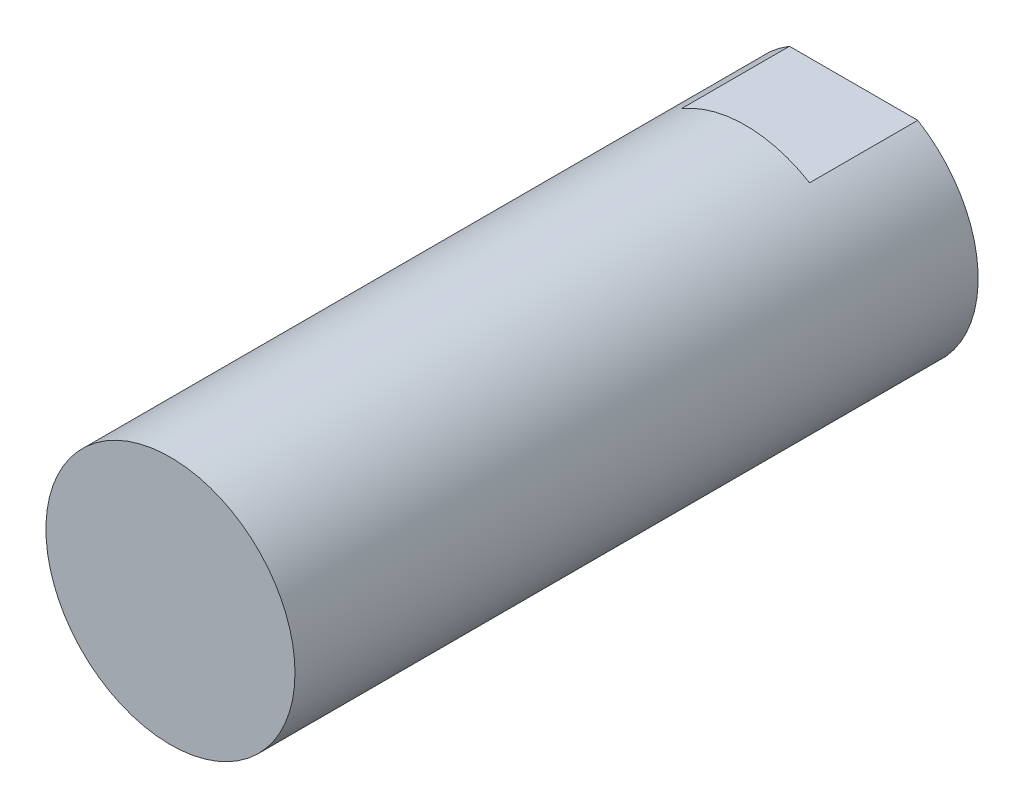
ISO-10303-21;
HEADER;
FILE_DESCRIPTION(('STEP AP214'),'2;1');
FILE_NAME('part.step','',(''),(''),'','','');
FILE_SCHEMA(('AUTOMOTIVE_DESIGN { 1 0 10303 214 1 1 1 1 }'));
ENDSEC;
DATA;
#1=APPLICATION_CONTEXT('core data for automotive mechanical design processes');
#2=APPLICATION_PROTOCOL_DEFINITION('international standard','automotive_design',2000,#1);
#3=PRODUCT_CONTEXT('',#1,'mechanical');
#4=PRODUCT('Part','Part','',(#3));
#5=PRODUCT_RELATED_PRODUCT_CATEGORY('part','',(#4));
#6=PRODUCT_DEFINITION_FORMATION('','',#4);
#7=PRODUCT_DEFINITION_CONTEXT('part definition',#1,'design');
#8=PRODUCT_DEFINITION('design','',#6,#7);
#9=PRODUCT_DEFINITION_SHAPE('','',#8);
#10=(LENGTH_UNIT() NAMED_UNIT(*) SI_UNIT(.MILLI.,.METRE.));
#11=(NAMED_UNIT(*) PLANE_ANGLE_UNIT() SI_UNIT($,.RADIAN.));
#12=(NAMED_UNIT(*) SI_UNIT($,.STERADIAN.) SOLID_ANGLE_UNIT());
#13=UNCERTAINTY_MEASURE_WITH_UNIT(LENGTH_MEASURE(1.E-05),#10,'distance_accuracy_value','');
#14=(GEOMETRIC_REPRESENTATION_CONTEXT(3) GLOBAL_UNCERTAINTY_ASSIGNED_CONTEXT((#13)) GLOBAL_UNIT_ASSIGNED_CONTEXT((#10,
#11,#12)) REPRESENTATION_CONTEXT('',''));
#15=CARTESIAN_POINT('',(0.,0.,0.));
#16=DIRECTION('',(0.,0.,1.));
#17=DIRECTION('',(1.,0.,0.));
#18=AXIS2_PLACEMENT_3D('',#15,#16,#17);
#19=CARTESIAN_POINT('',(0.,0.,22.86));
#20=DIRECTION('',(0.,0.,-1.));
#21=DIRECTION('',(-1.,0.,0.));
#22=AXIS2_PLACEMENT_3D('',#19,#20,#21);
#23=CYLINDRICAL_SURFACE('',#22,11.1125);
#24=DIRECTION('',(0.,0.,-1.));
#25=VECTOR('',#24,1.);
#26=CARTESIAN_POINT('',(5.72381264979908,9.525,22.86));
#27=LINE('',#26,#25);
#28=CARTESIAN_POINT('',(5.72381264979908,9.525,9.652));
#29=VERTEX_POINT('',#28);
#30=CARTESIAN_POINT('',(5.72381264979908,9.525,0.));
#31=VERTEX_POINT('',#30);
#32=EDGE_CURVE('E58',#29,#31,#27,.T.);
#33=ORIENTED_EDGE('',*,*,#32,.F.);
#34=CARTESIAN_POINT('',(0.,0.,9.652));
#35=DIRECTION('',(0.,0.,-1.));
#36=DIRECTION('',(-1.,0.,0.));
#37=AXIS2_PLACEMENT_3D('',#34,#35,#36);
#38=CIRCLE('',#37,11.1125);
#39=CARTESIAN_POINT('',(-5.72381264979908,9.525,9.652));
#40=VERTEX_POINT('',#39);
#41=EDGE_CURVE('E12',#40,#29,#38,.T.);
#42=ORIENTED_EDGE('',*,*,#41,.F.);
#43=DIRECTION('',(0.,0.,-1.));
#44=VECTOR('',#43,1.);
#45=CARTESIAN_POINT('',(-5.72381264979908,9.525,22.86));
#46=LINE('',#45,#44);
#47=CARTESIAN_POINT('',(-5.72381264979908,9.525,0.));
#48=VERTEX_POINT('',#47);
#49=EDGE_CURVE('E114',#48,#40,#46,.F.);
#50=ORIENTED_EDGE('',*,*,#49,.F.);
#51=CARTESIAN_POINT('',(0.,0.,0.));
#52=DIRECTION('',(0.,0.,1.));
#53=DIRECTION('',(1.,0.,0.));
#54=AXIS2_PLACEMENT_3D('',#51,#52,#53);
#55=CIRCLE('',#54,11.1125);
#56=CARTESIAN_POINT('',(-5.72381264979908,-9.525,0.));
#57=VERTEX_POINT('',#56);
#58=EDGE_CURVE('E94',#48,#57,#55,.T.);
#59=ORIENTED_EDGE('',*,*,#58,.T.);
#60=DIRECTION('',(0.,0.,-1.));
#61=VECTOR('',#60,1.);
#62=CARTESIAN_POINT('',(-5.72381264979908,-9.525,22.86));
#63=LINE('',#62,#61);
#64=CARTESIAN_POINT('',(-5.72381264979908,-9.525,9.652));
#65=VERTEX_POINT('',#64);
#66=EDGE_CURVE('E50',#65,#57,#63,.T.);
#67=ORIENTED_EDGE('',*,*,#66,.F.);
#68=CARTESIAN_POINT('',(5.72381264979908,-9.525,9.652));
#69=VERTEX_POINT('',#68);
#70=EDGE_CURVE('E39',#69,#65,#38,.T.);
#71=ORIENTED_EDGE('',*,*,#70,.F.);
#72=DIRECTION('',(0.,0.,-1.));
#73=VECTOR('',#72,1.);
#74=CARTESIAN_POINT('',(5.72381264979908,-9.525,22.86));
#75=LINE('',#74,#73);
#76=CARTESIAN_POINT('',(5.72381264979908,-9.525,0.));
#77=VERTEX_POINT('',#76);
#78=EDGE_CURVE('E77',#77,#69,#75,.F.);
#79=ORIENTED_EDGE('',*,*,#78,.F.);
#80=EDGE_CURVE('E90',#77,#31,#55,.T.);
#81=ORIENTED_EDGE('',*,*,#80,.T.);
#82=EDGE_LOOP('',(#33,#42,#50,#59,#67,#71,#79,#81));
#83=FACE_BOUND('',#82,.T.);
#84=CARTESIAN_POINT('',(0.,0.,60.96));
#85=DIRECTION('',(0.,0.,1.));
#86=DIRECTION('',(1.,0.,0.));
#87=AXIS2_PLACEMENT_3D('',#84,#85,#86);
#88=CIRCLE('',#87,11.1125);
#89=CARTESIAN_POINT('',(11.1125,0.,60.96));
#90=VERTEX_POINT('',#89);
#91=EDGE_CURVE('E163',#90,#90,#88,.T.);
#92=ORIENTED_EDGE('',*,*,#91,.F.);
#93=EDGE_LOOP('',(#92));
#94=FACE_BOUND('',#93,.T.);
#95=ADVANCED_FACE('F36',(#83,#94),#23,.T.);
#96=CARTESIAN_POINT('',(0.,0.,0.));
#97=DIRECTION('',(0.,0.,1.));
#98=DIRECTION('',(1.,0.,0.));
#99=AXIS2_PLACEMENT_3D('',#96,#97,#98);
#100=PLANE('',#99);
#101=CARTESIAN_POINT('',(0.,0.,0.));
#102=DIRECTION('',(0.,0.,-1.));
#103=DIRECTION('',(-1.,0.,0.));
#104=AXIS2_PLACEMENT_3D('',#101,#102,#103);
#105=CIRCLE('',#104,3.96875);
#106=CARTESIAN_POINT('',(-3.96875,0.,0.));
#107=VERTEX_POINT('',#106);
#108=EDGE_CURVE('E105',#107,#107,#105,.T.);
#109=ORIENTED_EDGE('',*,*,#108,.F.);
#110=EDGE_LOOP('',(#109));
#111=FACE_BOUND('',#110,.T.);
#112=DIRECTION('',(-1.,0.,0.));
#113=VECTOR('',#112,1.);
#114=CARTESIAN_POINT('',(0.,9.525,0.));
#115=LINE('',#114,#113);
#116=EDGE_CURVE('E83',#31,#48,#115,.T.);
#117=ORIENTED_EDGE('',*,*,#116,.F.);
#118=ORIENTED_EDGE('',*,*,#80,.F.);
#119=DIRECTION('',(1.,0.,0.));
#120=VECTOR('',#119,1.);
#121=CARTESIAN_POINT('',(0.,-9.525,0.));
#122=LINE('',#121,#120);
#123=EDGE_CURVE('E74',#57,#77,#122,.T.);
#124=ORIENTED_EDGE('',*,*,#123,.F.);
#125=ORIENTED_EDGE('',*,*,#58,.F.);
#126=EDGE_LOOP('',(#117,#118,#124,#125));
#127=FACE_BOUND('',#126,.T.);
#128=ADVANCED_FACE('F93',(#111,#127),#100,.F.);
#129=CARTESIAN_POINT('',(0.,0.,11.938));
#130=DIRECTION('',(0.,0.,1.));
#131=DIRECTION('',(1.,0.,0.));
#132=AXIS2_PLACEMENT_3D('',#129,#130,#131);
#133=CYLINDRICAL_SURFACE('',#132,5.55625);
#134=CARTESIAN_POINT('',(0.,0.,21.10023637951));
#135=DIRECTION('',(0.,0.,1.));
#136=DIRECTION('',(1.,0.,0.));
#137=AXIS2_PLACEMENT_3D('',#134,#135,#136);
#138=CIRCLE('',#137,5.55625);
#139=CARTESIAN_POINT('',(5.55625,0.,21.10023637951));
#140=VERTEX_POINT('',#139);
#141=EDGE_CURVE('E97',#140,#140,#138,.T.);
#142=ORIENTED_EDGE('',*,*,#141,.T.);
#143=EDGE_LOOP('',(#142));
#144=FACE_BOUND('',#143,.T.);
#145=CARTESIAN_POINT('',(0.,0.,11.938));
#146=DIRECTION('',(0.,0.,1.));
#147=DIRECTION('',(1.,0.,0.));
#148=AXIS2_PLACEMENT_3D('',#145,#146,#147);
#149=CIRCLE('',#148,5.55625);
#150=CARTESIAN_POINT('',(5.55625,0.,11.938));
#151=VERTEX_POINT('',#150);
#152=EDGE_CURVE('E95',#151,#151,#149,.T.);
#153=ORIENTED_EDGE('',*,*,#152,.F.);
#154=EDGE_LOOP('',(#153));
#155=FACE_BOUND('',#154,.T.);
#156=ADVANCED_FACE('F124',(#144,#155),#133,.F.);
#157=CARTESIAN_POINT('',(0.,0.,11.938));
#158=DIRECTION('',(0.,0.,1.));
#159=DIRECTION('',(1.,0.,0.));
#160=AXIS2_PLACEMENT_3D('',#157,#158,#159);
#161=PLANE('',#160);
#162=CARTESIAN_POINT('',(0.,0.,11.938));
#163=DIRECTION('',(0.,0.,1.));
#164=DIRECTION('',(1.,0.,0.));
#165=AXIS2_PLACEMENT_3D('',#162,#163,#164);
#166=CIRCLE('',#165,3.96875);
#167=CARTESIAN_POINT('',(3.96875,0.,11.938));
#168=VERTEX_POINT('',#167);
#169=EDGE_CURVE('E99',#168,#168,#166,.T.);
#170=ORIENTED_EDGE('',*,*,#169,.F.);
#171=EDGE_LOOP('',(#170));
#172=FACE_BOUND('',#171,.T.);
#173=ORIENTED_EDGE('',*,*,#152,.T.);
#174=EDGE_LOOP('',(#173));
#175=FACE_BOUND('',#174,.T.);
#176=ADVANCED_FACE('F129',(#172,#175),#161,.T.);
#177=CARTESIAN_POINT('',(0.,0.,22.86));
#178=DIRECTION('',(0.,0.,-1.));
#179=DIRECTION('',(-1.,0.,0.));
#180=AXIS2_PLACEMENT_3D('',#177,#178,#179);
#181=CYLINDRICAL_SURFACE('',#180,3.96875);
#182=ORIENTED_EDGE('',*,*,#169,.T.);
#183=EDGE_LOOP('',(#182));
#184=FACE_BOUND('',#183,.T.);
#185=ORIENTED_EDGE('',*,*,#108,.T.);
#186=EDGE_LOOP('',(#185));
#187=FACE_BOUND('',#186,.T.);
#188=ADVANCED_FACE('F121',(#184,#187),#181,.F.);
#189=CARTESIAN_POINT('',(0.,0.,21.10023637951));
#190=DIRECTION('',(0.,0.,1.));
#191=DIRECTION('',(1.,0.,0.));
#192=AXIS2_PLACEMENT_3D('',#189,#190,#191);
#193=CONICAL_SURFACE('',#192,5.55625,0.523598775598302);
#194=CARTESIAN_POINT('',(0.,0.,22.86));
#195=DIRECTION('',(0.,0.,1.));
#196=DIRECTION('',(1.,0.,0.));
#197=AXIS2_PLACEMENT_3D('',#194,#195,#196);
#198=CIRCLE('',#197,6.57225000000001);
#199=CARTESIAN_POINT('',(6.57225000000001,0.,22.86));
#200=VERTEX_POINT('',#199);
#201=EDGE_CURVE('E84',#200,#200,#198,.F.);
#202=ORIENTED_EDGE('',*,*,#201,.F.);
#203=EDGE_LOOP('',(#202));
#204=FACE_BOUND('',#203,.T.);
#205=ORIENTED_EDGE('',*,*,#141,.F.);
#206=EDGE_LOOP('',(#205));
#207=FACE_BOUND('',#206,.T.);
#208=ADVANCED_FACE('F138',(#204,#207),#193,.F.);
#209=CARTESIAN_POINT('',(-13.4236822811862,-9.525,9.652));
#210=DIRECTION('',(0.,-1.,0.));
#211=DIRECTION('',(1.,0.,0.));
#212=AXIS2_PLACEMENT_3D('',#209,#210,#211);
#213=PLANE('',#212);
#214=ORIENTED_EDGE('',*,*,#66,.T.);
#215=ORIENTED_EDGE('',*,*,#123,.T.);
#216=ORIENTED_EDGE('',*,*,#78,.T.);
#217=DIRECTION('',(-1.,0.,0.));
#218=VECTOR('',#217,1.);
#219=CARTESIAN_POINT('',(-13.4236822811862,-9.525,9.652));
#220=LINE('',#219,#218);
#221=EDGE_CURVE('E91',#69,#65,#220,.T.);
#222=ORIENTED_EDGE('',*,*,#221,.T.);
#223=EDGE_LOOP('',(#214,#215,#216,#222));
#224=FACE_BOUND('',#223,.T.);
#225=ADVANCED_FACE('F76',(#224),#213,.T.);
#226=CARTESIAN_POINT('',(-0.572031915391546,0.,9.652));
#227=DIRECTION('',(0.,0.,-1.));
#228=DIRECTION('',(-1.,0.,0.));
#229=AXIS2_PLACEMENT_3D('',#226,#227,#228);
#230=PLANE('',#229);
#231=ORIENTED_EDGE('',*,*,#70,.T.);
#232=ORIENTED_EDGE('',*,*,#221,.F.);
#233=EDGE_LOOP('',(#231,#232));
#234=FACE_BOUND('',#233,.T.);
#235=ADVANCED_FACE('F111',(#234),#230,.T.);
#236=ORIENTED_EDGE('',*,*,#41,.T.);
#237=DIRECTION('',(1.,0.,0.));
#238=VECTOR('',#237,1.);
#239=CARTESIAN_POINT('',(12.2796184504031,9.525,9.652));
#240=LINE('',#239,#238);
#241=EDGE_CURVE('E112',#40,#29,#240,.T.);
#242=ORIENTED_EDGE('',*,*,#241,.F.);
#243=EDGE_LOOP('',(#236,#242));
#244=FACE_BOUND('',#243,.T.);
#245=ADVANCED_FACE('F143',(#244),#230,.T.);
#246=CARTESIAN_POINT('',(0.,9.525,9.652));
#247=DIRECTION('',(0.,1.,0.));
#248=DIRECTION('',(0.,0.,1.));
#249=AXIS2_PLACEMENT_3D('',#246,#247,#248);
#250=PLANE('',#249);
#251=ORIENTED_EDGE('',*,*,#32,.T.);
#252=ORIENTED_EDGE('',*,*,#116,.T.);
#253=ORIENTED_EDGE('',*,*,#49,.T.);
#254=ORIENTED_EDGE('',*,*,#241,.T.);
#255=EDGE_LOOP('',(#251,#252,#253,#254));
#256=FACE_BOUND('',#255,.T.);
#257=ADVANCED_FACE('F146',(#256),#250,.T.);
#258=CARTESIAN_POINT('',(0.,0.,22.86));
#259=DIRECTION('',(0.,0.,1.));
#260=DIRECTION('',(1.,0.,0.));
#261=AXIS2_PLACEMENT_3D('',#258,#259,#260);
#262=PLANE('',#261);
#263=ORIENTED_EDGE('',*,*,#201,.T.);
#264=EDGE_LOOP('',(#263));
#265=FACE_BOUND('',#264,.T.);
#266=ADVANCED_FACE('F152',(#265),#262,.F.);
#267=CARTESIAN_POINT('',(0.,0.,60.96));
#268=DIRECTION('',(0.,0.,1.));
#269=DIRECTION('',(1.,0.,0.));
#270=AXIS2_PLACEMENT_3D('',#267,#268,#269);
#271=PLANE('',#270);
#272=ORIENTED_EDGE('',*,*,#91,.T.);
#273=EDGE_LOOP('',(#272));
#274=FACE_BOUND('',#273,.T.);
#275=ADVANCED_FACE('F155',(#274),#271,.T.);
#276=CLOSED_SHELL('',(#95,#128,#156,#176,#188,#208,#225,#235,#245,#257,#266,#275));
#277=MANIFOLD_SOLID_BREP('B2',#276);
#278=ADVANCED_BREP_SHAPE_REPRESENTATION('',(#18,#277),#14);
#279=SHAPE_DEFINITION_REPRESENTATION(#9,#278);
ENDSEC;
END-ISO-10303-21;
